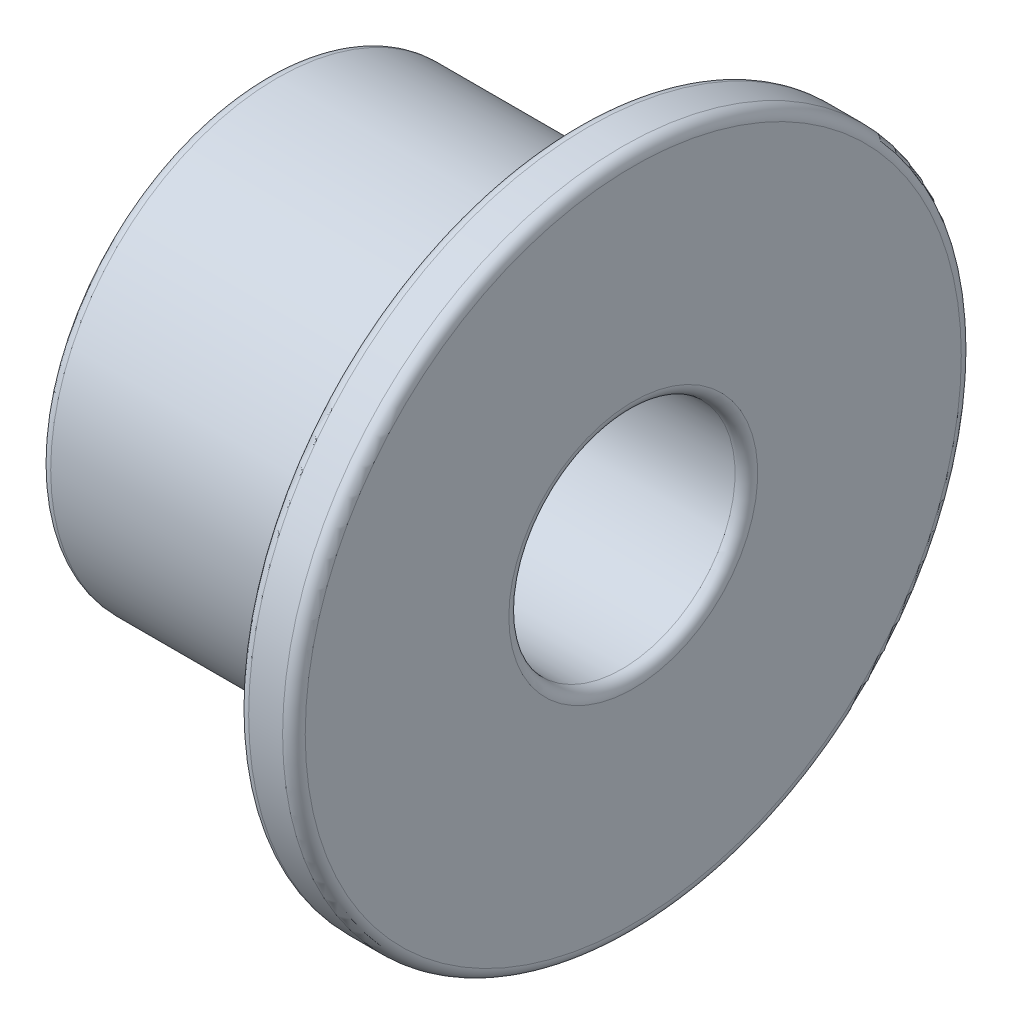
from build123d import *

# Parameters (mm, degrees)
CONG_1_R = 0.2


with BuildPart() as part:
    # Esquisse1 → R_volution1 (revolve)
    with BuildSketch(Plane.XY, mode=Mode.PRIVATE) as r_volution1_sk:
        Polygon((0, 2), (6.5, 2), (6.5, 6), (5.5, 6), (5.5, 4), (0, 4), align=None)
    revolve(r_volution1_sk.sketch.rotate(Axis((0, 0, 0), (1, 0, 0)), 270), axis=Axis((0, 0, 0), (1, 0, 0)))

    # Cong_1
    cong_1_edges = [part.edges().sort_by_distance(p)[0] for p in [
        (0, 0, 2),
        (6.5, 0, 2),
        (6.5, 0, 6),
        (5.5, 0, 6),
        (5.5, 0, 4),
        (0, 0, 4),
    ]]
    fillet(cong_1_edges, radius=CONG_1_R)


solid = part.part
